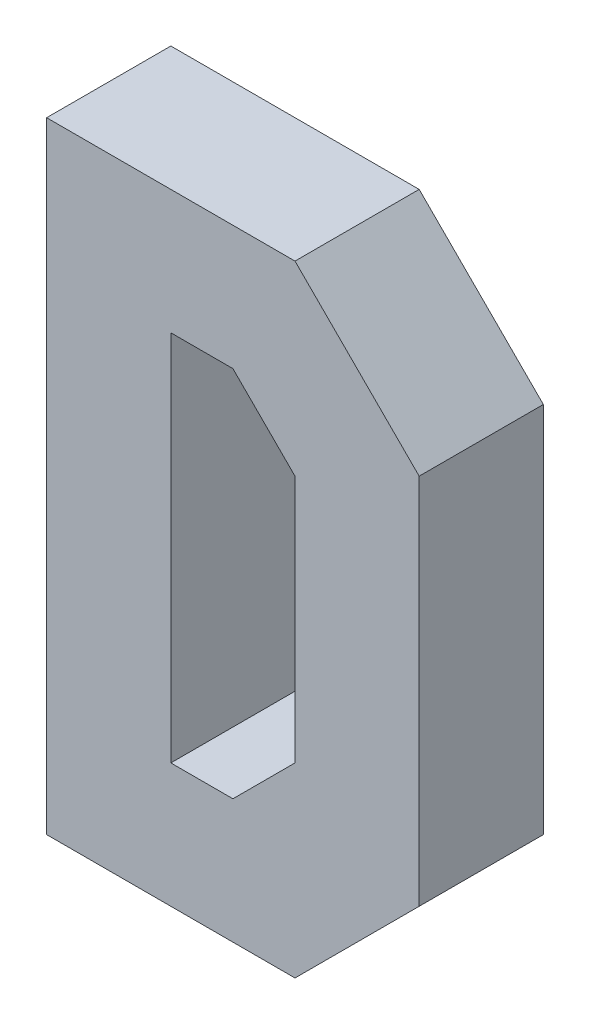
from build123d import *

# Parameters (mm, degrees)
ESQUISSE1_W        = 30
ESQUISSE1_H        = 50
ESQUISSE1_W_2      = 10
ESQUISSE1_H_2      = 30
BOSS_EXTRU_1_DEPTH = 10
CHANFREIN1_SIZE    = 10
CHANFREIN2_SIZE    = 5


with BuildPart() as part:
    # Esquisse1 → Boss.-Extru.1 (new body)
    with BuildSketch(Plane.XY):
        with Locations((15, 25)):
            Rectangle(ESQUISSE1_W, ESQUISSE1_H)
        with Locations((15, 25)):
            Rectangle(ESQUISSE1_W_2, ESQUISSE1_H_2, mode=Mode.SUBTRACT)
    extrude(amount=BOSS_EXTRU_1_DEPTH)

    # Chanfrein1
    chanfrein1_edges = [part.edges().sort_by_distance(p)[0] for p in [
        (30, 50, 5),
        (30, 0, 5),
    ]]
    chamfer(chanfrein1_edges, length=CHANFREIN1_SIZE)

    # Chanfrein2
    chanfrein2_edges = [part.edges().sort_by_distance(p)[0] for p in [
        (20, 10, 5),
        (20, 40, 5),
    ]]
    chamfer(chanfrein2_edges, length=CHANFREIN2_SIZE)


solid = part.part
